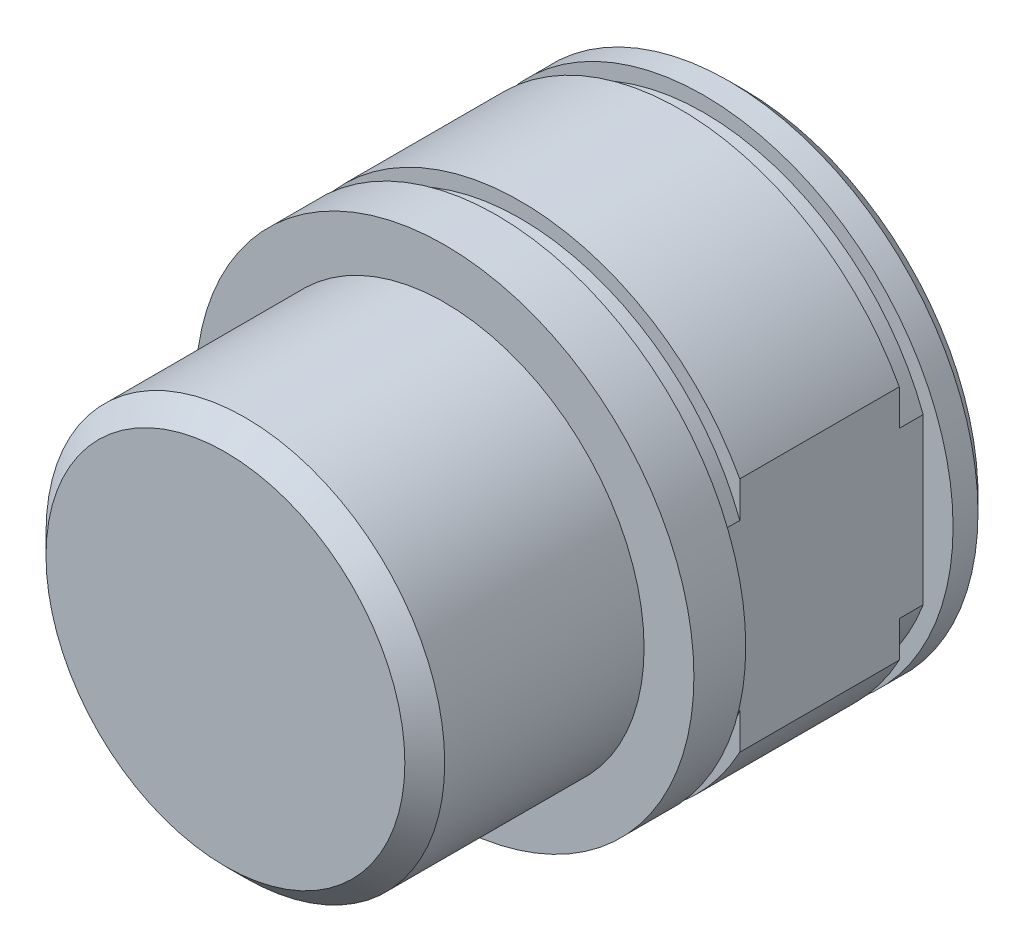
ISO-10303-21;
HEADER;
FILE_DESCRIPTION(('STEP AP214'),'2;1');
FILE_NAME('part.step','',(''),(''),'','','');
FILE_SCHEMA(('AUTOMOTIVE_DESIGN { 1 0 10303 214 1 1 1 1 }'));
ENDSEC;
DATA;
#1=APPLICATION_CONTEXT('core data for automotive mechanical design processes');
#2=APPLICATION_PROTOCOL_DEFINITION('international standard','automotive_design',2000,#1);
#3=PRODUCT_CONTEXT('',#1,'mechanical');
#4=PRODUCT('Part','Part','',(#3));
#5=PRODUCT_RELATED_PRODUCT_CATEGORY('part','',(#4));
#6=PRODUCT_DEFINITION_FORMATION('','',#4);
#7=PRODUCT_DEFINITION_CONTEXT('part definition',#1,'design');
#8=PRODUCT_DEFINITION('design','',#6,#7);
#9=PRODUCT_DEFINITION_SHAPE('','',#8);
#10=(LENGTH_UNIT() NAMED_UNIT(*) SI_UNIT(.MILLI.,.METRE.));
#11=(NAMED_UNIT(*) PLANE_ANGLE_UNIT() SI_UNIT($,.RADIAN.));
#12=(NAMED_UNIT(*) SI_UNIT($,.STERADIAN.) SOLID_ANGLE_UNIT());
#13=UNCERTAINTY_MEASURE_WITH_UNIT(LENGTH_MEASURE(1.E-05),#10,'distance_accuracy_value','');
#14=(GEOMETRIC_REPRESENTATION_CONTEXT(3) GLOBAL_UNCERTAINTY_ASSIGNED_CONTEXT((#13)) GLOBAL_UNIT_ASSIGNED_CONTEXT((#10,
#11,#12)) REPRESENTATION_CONTEXT('',''));
#15=CARTESIAN_POINT('',(0.,0.,0.));
#16=DIRECTION('',(0.,0.,1.));
#17=DIRECTION('',(1.,0.,0.));
#18=AXIS2_PLACEMENT_3D('',#15,#16,#17);
#19=CARTESIAN_POINT('',(0.,0.,26.));
#20=DIRECTION('',(0.,0.,-1.));
#21=DIRECTION('',(-1.,0.,0.));
#22=AXIS2_PLACEMENT_3D('',#19,#20,#21);
#23=PLANE('',#22);
#24=CARTESIAN_POINT('',(0.,0.,26.0000000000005));
#25=DIRECTION('',(0.,0.,-1.));
#26=DIRECTION('',(0.,1.,0.));
#27=AXIS2_PLACEMENT_3D('',#24,#25,#26);
#28=CIRCLE('',#27,9.00000000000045);
#29=CARTESIAN_POINT('',(0.,9.00000000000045,26.0000000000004));
#30=VERTEX_POINT('',#29);
#31=EDGE_CURVE('E21',#30,#30,#28,.T.);
#32=ORIENTED_EDGE('',*,*,#31,.F.);
#33=EDGE_LOOP('',(#32));
#34=FACE_BOUND('',#33,.T.);
#35=ADVANCED_FACE('F17',(#34),#23,.F.);
#36=CARTESIAN_POINT('',(0.,0.,25.));
#37=DIRECTION('',(0.,0.,-1.));
#38=DIRECTION('',(0.,1.,0.));
#39=AXIS2_PLACEMENT_3D('',#36,#37,#38);
#40=CONICAL_SURFACE('',#39,10.,0.785398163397);
#41=CARTESIAN_POINT('',(0.,0.,25.));
#42=DIRECTION('',(0.,0.,1.));
#43=DIRECTION('',(1.,0.,0.));
#44=AXIS2_PLACEMENT_3D('',#41,#42,#43);
#45=CIRCLE('',#44,10.);
#46=CARTESIAN_POINT('',(10.,0.,25.));
#47=VERTEX_POINT('',#46);
#48=EDGE_CURVE('E161',#47,#47,#45,.F.);
#49=ORIENTED_EDGE('',*,*,#48,.F.);
#50=EDGE_LOOP('',(#49));
#51=FACE_BOUND('',#50,.T.);
#52=ORIENTED_EDGE('',*,*,#31,.T.);
#53=EDGE_LOOP('',(#52));
#54=FACE_BOUND('',#53,.T.);
#55=ADVANCED_FACE('F437',(#51,#54),#40,.T.);
#56=CARTESIAN_POINT('',(0.,0.,15.));
#57=DIRECTION('',(0.,0.,1.));
#58=DIRECTION('',(1.,0.,0.));
#59=AXIS2_PLACEMENT_3D('',#56,#57,#58);
#60=CYLINDRICAL_SURFACE('',#59,10.);
#61=ORIENTED_EDGE('',*,*,#48,.T.);
#62=EDGE_LOOP('',(#61));
#63=FACE_BOUND('',#62,.T.);
#64=CARTESIAN_POINT('',(0.,0.,15.));
#65=DIRECTION('',(0.,0.,1.));
#66=DIRECTION('',(1.,0.,0.));
#67=AXIS2_PLACEMENT_3D('',#64,#65,#66);
#68=CIRCLE('',#67,10.);
#69=CARTESIAN_POINT('',(10.,0.,15.));
#70=VERTEX_POINT('',#69);
#71=EDGE_CURVE('E163',#70,#70,#68,.T.);
#72=ORIENTED_EDGE('',*,*,#71,.T.);
#73=EDGE_LOOP('',(#72));
#74=FACE_BOUND('',#73,.T.);
#75=ADVANCED_FACE('F210',(#63,#74),#60,.T.);
#76=CARTESIAN_POINT('',(0.,0.,15.));
#77=DIRECTION('',(0.,0.,-1.));
#78=DIRECTION('',(-1.,0.,0.));
#79=AXIS2_PLACEMENT_3D('',#76,#77,#78);
#80=PLANE('',#79);
#81=ORIENTED_EDGE('',*,*,#71,.F.);
#82=EDGE_LOOP('',(#81));
#83=FACE_BOUND('',#82,.T.);
#84=CARTESIAN_POINT('',(0.,0.,15.));
#85=DIRECTION('',(0.,0.,1.));
#86=DIRECTION('',(1.,0.,0.));
#87=AXIS2_PLACEMENT_3D('',#84,#85,#86);
#88=CIRCLE('',#87,12.5);
#89=CARTESIAN_POINT('',(12.5,0.,15.));
#90=VERTEX_POINT('',#89);
#91=EDGE_CURVE('E160',#90,#90,#88,.F.);
#92=ORIENTED_EDGE('',*,*,#91,.F.);
#93=EDGE_LOOP('',(#92));
#94=FACE_BOUND('',#93,.T.);
#95=ADVANCED_FACE('F212',(#83,#94),#80,.F.);
#96=CARTESIAN_POINT('',(0.,0.,0.));
#97=DIRECTION('',(0.,0.,1.));
#98=DIRECTION('',(1.,0.,0.));
#99=AXIS2_PLACEMENT_3D('',#96,#97,#98);
#100=CYLINDRICAL_SURFACE('',#99,12.5);
#101=ORIENTED_EDGE('',*,*,#91,.T.);
#102=EDGE_LOOP('',(#101));
#103=FACE_BOUND('',#102,.T.);
#104=CARTESIAN_POINT('',(0.,0.,12.4000000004));
#105=DIRECTION('',(0.,0.,1.));
#106=DIRECTION('',(1.,0.,0.));
#107=AXIS2_PLACEMENT_3D('',#104,#105,#106);
#108=CIRCLE('',#107,12.5);
#109=CARTESIAN_POINT('',(12.5,0.,12.4000000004));
#110=VERTEX_POINT('',#109);
#111=EDGE_CURVE('E199',#110,#110,#108,.T.);
#112=ORIENTED_EDGE('',*,*,#111,.T.);
#113=EDGE_LOOP('',(#112));
#114=FACE_BOUND('',#113,.T.);
#115=ADVANCED_FACE('F215',(#103,#114),#100,.T.);
#116=CARTESIAN_POINT('',(0.,0.,11.2));
#117=DIRECTION('',(0.,0.,1.));
#118=DIRECTION('',(1.,0.,0.));
#119=AXIS2_PLACEMENT_3D('',#116,#117,#118);
#120=CYLINDRICAL_SURFACE('',#119,11.75);
#121=DIRECTION('',(0.,0.,1.));
#122=VECTOR('',#121,1.);
#123=CARTESIAN_POINT('',(-10.9999999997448,4.13067791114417,11.2));
#124=LINE('',#123,#122);
#125=CARTESIAN_POINT('',(-10.9999999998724,4.13067791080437,11.2));
#126=VERTEX_POINT('',#125);
#127=CARTESIAN_POINT('',(-10.9999999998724,4.13067791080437,12.3999999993));
#128=VERTEX_POINT('',#127);
#129=EDGE_CURVE('E156',#126,#128,#124,.T.);
#130=ORIENTED_EDGE('',*,*,#129,.T.);
#131=CARTESIAN_POINT('',(0.,0.,12.3999999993));
#132=DIRECTION('',(0.,0.,1.));
#133=DIRECTION('',(1.,0.,0.));
#134=AXIS2_PLACEMENT_3D('',#131,#132,#133);
#135=CIRCLE('',#134,11.75);
#136=CARTESIAN_POINT('',(11.0000000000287,4.13067791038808,12.3999999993));
#137=VERTEX_POINT('',#136);
#138=EDGE_CURVE('E193',#128,#137,#135,.F.);
#139=ORIENTED_EDGE('',*,*,#138,.T.);
#140=DIRECTION('',(0.,0.,1.));
#141=VECTOR('',#140,1.);
#142=CARTESIAN_POINT('',(11.0000000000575,4.13067791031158,11.2));
#143=LINE('',#142,#141);
#144=CARTESIAN_POINT('',(11.0000000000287,4.13067791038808,11.2));
#145=VERTEX_POINT('',#144);
#146=EDGE_CURVE('E158',#137,#145,#143,.F.);
#147=ORIENTED_EDGE('',*,*,#146,.T.);
#148=CARTESIAN_POINT('',(0.,0.,11.2));
#149=DIRECTION('',(0.,0.,1.));
#150=DIRECTION('',(1.,0.,0.));
#151=AXIS2_PLACEMENT_3D('',#148,#149,#150);
#152=CIRCLE('',#151,11.75);
#153=EDGE_CURVE('E202',#126,#145,#152,.F.);
#154=ORIENTED_EDGE('',*,*,#153,.F.);
#155=EDGE_LOOP('',(#130,#139,#147,#154));
#156=FACE_BOUND('',#155,.T.);
#157=ADVANCED_FACE('F221',(#156),#120,.T.);
#158=CARTESIAN_POINT('',(0.,0.,11.2));
#159=DIRECTION('',(0.,0.,1.));
#160=DIRECTION('',(1.,0.,0.));
#161=AXIS2_PLACEMENT_3D('',#158,#159,#160);
#162=CYLINDRICAL_SURFACE('',#161,11.75);
#163=DIRECTION('',(0.,0.,1.));
#164=VECTOR('',#163,1.);
#165=CARTESIAN_POINT('',(-11.0000000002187,-4.13067790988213,11.2));
#166=LINE('',#165,#164);
#167=CARTESIAN_POINT('',(-11.0000000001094,-4.13067791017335,12.3999999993));
#168=VERTEX_POINT('',#167);
#169=CARTESIAN_POINT('',(-11.0000000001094,-4.13067791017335,11.2));
#170=VERTEX_POINT('',#169);
#171=EDGE_CURVE('E115',#168,#170,#166,.F.);
#172=ORIENTED_EDGE('',*,*,#171,.T.);
#173=CARTESIAN_POINT('',(0.,0.,11.2));
#174=DIRECTION('',(0.,0.,1.));
#175=DIRECTION('',(1.,0.,0.));
#176=AXIS2_PLACEMENT_3D('',#173,#174,#175);
#177=CIRCLE('',#176,11.75);
#178=CARTESIAN_POINT('',(10.999999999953,-4.13067791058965,11.2));
#179=VERTEX_POINT('',#178);
#180=EDGE_CURVE('E190',#179,#170,#177,.F.);
#181=ORIENTED_EDGE('',*,*,#180,.F.);
#182=DIRECTION('',(0.,0.,1.));
#183=VECTOR('',#182,1.);
#184=CARTESIAN_POINT('',(10.9999999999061,-4.13067791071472,11.2));
#185=LINE('',#184,#183);
#186=CARTESIAN_POINT('',(10.999999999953,-4.13067791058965,12.3999999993));
#187=VERTEX_POINT('',#186);
#188=EDGE_CURVE('E154',#179,#187,#185,.T.);
#189=ORIENTED_EDGE('',*,*,#188,.T.);
#190=CARTESIAN_POINT('',(0.,0.,12.3999999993));
#191=DIRECTION('',(0.,0.,1.));
#192=DIRECTION('',(1.,0.,0.));
#193=AXIS2_PLACEMENT_3D('',#190,#191,#192);
#194=CIRCLE('',#193,11.75);
#195=EDGE_CURVE('E196',#187,#168,#194,.F.);
#196=ORIENTED_EDGE('',*,*,#195,.T.);
#197=EDGE_LOOP('',(#172,#181,#189,#196));
#198=FACE_BOUND('',#197,.T.);
#199=ADVANCED_FACE('F323',(#198),#162,.T.);
#200=CARTESIAN_POINT('',(0.,0.,3.2));
#201=DIRECTION('',(0.,0.,1.));
#202=DIRECTION('',(1.,0.,0.));
#203=AXIS2_PLACEMENT_3D('',#200,#201,#202);
#204=PLANE('',#203);
#205=DIRECTION('',(0.,1.,0.));
#206=VECTOR('',#205,1.);
#207=CARTESIAN_POINT('',(11.,0.424748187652,3.19999999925));
#208=LINE('',#207,#206);
#209=CARTESIAN_POINT('',(11.,4.13067791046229,3.19999999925));
#210=VERTEX_POINT('',#209);
#211=CARTESIAN_POINT('',(11.,5.93717104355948,3.199999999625));
#212=VERTEX_POINT('',#211);
#213=EDGE_CURVE('E109',#210,#212,#208,.T.);
#214=ORIENTED_EDGE('',*,*,#213,.F.);
#215=CARTESIAN_POINT('',(0.,0.,3.19999999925));
#216=DIRECTION('',(0.,0.,1.));
#217=DIRECTION('',(1.,0.,0.));
#218=AXIS2_PLACEMENT_3D('',#215,#216,#217);
#219=CIRCLE('',#218,11.75);
#220=CARTESIAN_POINT('',(-10.9999999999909,4.13067791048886,3.19999999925));
#221=VERTEX_POINT('',#220);
#222=EDGE_CURVE('E181',#221,#210,#219,.F.);
#223=ORIENTED_EDGE('',*,*,#222,.F.);
#224=DIRECTION('',(0.,1.,0.));
#225=VECTOR('',#224,1.);
#226=CARTESIAN_POINT('',(-11.,-1.13011362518,3.19999999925));
#227=LINE('',#226,#225);
#228=CARTESIAN_POINT('',(-11.,5.93717104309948,3.199999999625));
#229=VERTEX_POINT('',#228);
#230=EDGE_CURVE('E111',#221,#229,#227,.T.);
#231=ORIENTED_EDGE('',*,*,#230,.T.);
#232=CARTESIAN_POINT('',(0.,0.,3.2));
#233=DIRECTION('',(0.,0.,1.));
#234=DIRECTION('',(1.,0.,0.));
#235=AXIS2_PLACEMENT_3D('',#232,#233,#234);
#236=CIRCLE('',#235,12.5);
#237=EDGE_CURVE('E104',#212,#229,#236,.T.);
#238=ORIENTED_EDGE('',*,*,#237,.F.);
#239=EDGE_LOOP('',(#214,#223,#231,#238));
#240=FACE_BOUND('',#239,.T.);
#241=ADVANCED_FACE('F106',(#240),#204,.F.);
#242=CARTESIAN_POINT('',(0.,0.,0.));
#243=DIRECTION('',(0.,0.,1.));
#244=DIRECTION('',(1.,0.,0.));
#245=AXIS2_PLACEMENT_3D('',#242,#243,#244);
#246=CYLINDRICAL_SURFACE('',#245,12.5);
#247=DIRECTION('',(0.,0.,1.));
#248=VECTOR('',#247,1.);
#249=CARTESIAN_POINT('',(-11.,5.93717104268,7.2));
#250=LINE('',#249,#248);
#251=CARTESIAN_POINT('',(-11.,5.93717104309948,11.2));
#252=VERTEX_POINT('',#251);
#253=EDGE_CURVE('E136',#229,#252,#250,.T.);
#254=ORIENTED_EDGE('',*,*,#253,.T.);
#255=CARTESIAN_POINT('',(0.,0.,11.2));
#256=DIRECTION('',(0.,0.,1.));
#257=DIRECTION('',(1.,0.,0.));
#258=AXIS2_PLACEMENT_3D('',#255,#256,#257);
#259=CIRCLE('',#258,12.5);
#260=CARTESIAN_POINT('',(11.,5.93717104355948,11.2));
#261=VERTEX_POINT('',#260);
#262=EDGE_CURVE('E114',#261,#252,#259,.T.);
#263=ORIENTED_EDGE('',*,*,#262,.F.);
#264=DIRECTION('',(0.,0.,1.));
#265=VECTOR('',#264,1.);
#266=CARTESIAN_POINT('',(11.,5.9371710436,7.2));
#267=LINE('',#266,#265);
#268=EDGE_CURVE('E118',#212,#261,#267,.T.);
#269=ORIENTED_EDGE('',*,*,#268,.F.);
#270=ORIENTED_EDGE('',*,*,#237,.T.);
#271=EDGE_LOOP('',(#254,#263,#269,#270));
#272=FACE_BOUND('',#271,.T.);
#273=ADVANCED_FACE('F119',(#272),#246,.T.);
#274=CARTESIAN_POINT('',(0.,0.,11.2));
#275=DIRECTION('',(0.,0.,1.));
#276=DIRECTION('',(1.,0.,0.));
#277=AXIS2_PLACEMENT_3D('',#274,#275,#276);
#278=PLANE('',#277);
#279=DIRECTION('',(0.,1.,0.));
#280=VECTOR('',#279,1.);
#281=CARTESIAN_POINT('',(-11.,-1.13011362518,11.2));
#282=LINE('',#281,#280);
#283=EDGE_CURVE('E139',#252,#126,#282,.F.);
#284=ORIENTED_EDGE('',*,*,#283,.T.);
#285=ORIENTED_EDGE('',*,*,#153,.T.);
#286=DIRECTION('',(0.,1.,0.));
#287=VECTOR('',#286,1.);
#288=CARTESIAN_POINT('',(11.,0.424748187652,11.2));
#289=LINE('',#288,#287);
#290=EDGE_CURVE('E124',#261,#145,#289,.F.);
#291=ORIENTED_EDGE('',*,*,#290,.F.);
#292=ORIENTED_EDGE('',*,*,#262,.T.);
#293=EDGE_LOOP('',(#284,#285,#291,#292));
#294=FACE_BOUND('',#293,.T.);
#295=ADVANCED_FACE('F228',(#294),#278,.T.);
#296=CARTESIAN_POINT('',(0.,0.,12.4));
#297=DIRECTION('',(0.,0.,1.));
#298=DIRECTION('',(1.,0.,0.));
#299=AXIS2_PLACEMENT_3D('',#296,#297,#298);
#300=PLANE('',#299);
#301=ORIENTED_EDGE('',*,*,#138,.F.);
#302=DIRECTION('',(0.,1.,0.));
#303=VECTOR('',#302,1.);
#304=CARTESIAN_POINT('',(-11.,-1.13011362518,12.3999999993));
#305=LINE('',#304,#303);
#306=EDGE_CURVE('E149',#128,#168,#305,.F.);
#307=ORIENTED_EDGE('',*,*,#306,.T.);
#308=ORIENTED_EDGE('',*,*,#195,.F.);
#309=DIRECTION('',(0.,1.,0.));
#310=VECTOR('',#309,1.);
#311=CARTESIAN_POINT('',(11.,0.424748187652,12.3999999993));
#312=LINE('',#311,#310);
#313=EDGE_CURVE('E314',#137,#187,#312,.F.);
#314=ORIENTED_EDGE('',*,*,#313,.F.);
#315=EDGE_LOOP('',(#301,#307,#308,#314));
#316=FACE_BOUND('',#315,.T.);
#317=ORIENTED_EDGE('',*,*,#111,.F.);
#318=EDGE_LOOP('',(#317));
#319=FACE_BOUND('',#318,.T.);
#320=ADVANCED_FACE('F225',(#316,#319),#300,.F.);
#321=CARTESIAN_POINT('',(0.,0.,11.2));
#322=DIRECTION('',(0.,0.,1.));
#323=DIRECTION('',(1.,0.,0.));
#324=AXIS2_PLACEMENT_3D('',#321,#322,#323);
#325=PLANE('',#324);
#326=DIRECTION('',(0.,1.,0.));
#327=VECTOR('',#326,1.);
#328=CARTESIAN_POINT('',(-11.,-1.13011362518,11.2));
#329=LINE('',#328,#327);
#330=CARTESIAN_POINT('',(-11.,-5.93717104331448,11.2));
#331=VERTEX_POINT('',#330);
#332=EDGE_CURVE('E147',#170,#331,#329,.F.);
#333=ORIENTED_EDGE('',*,*,#332,.T.);
#334=CARTESIAN_POINT('',(0.,0.,11.2));
#335=DIRECTION('',(0.,0.,1.));
#336=DIRECTION('',(1.,0.,0.));
#337=AXIS2_PLACEMENT_3D('',#334,#335,#336);
#338=CIRCLE('',#337,12.5);
#339=CARTESIAN_POINT('',(11.,-5.93717104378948,11.2));
#340=VERTEX_POINT('',#339);
#341=EDGE_CURVE('E187',#340,#331,#338,.F.);
#342=ORIENTED_EDGE('',*,*,#341,.F.);
#343=DIRECTION('',(0.,1.,0.));
#344=VECTOR('',#343,1.);
#345=CARTESIAN_POINT('',(11.,0.424748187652,11.2));
#346=LINE('',#345,#344);
#347=EDGE_CURVE('E310',#179,#340,#346,.F.);
#348=ORIENTED_EDGE('',*,*,#347,.F.);
#349=ORIENTED_EDGE('',*,*,#180,.T.);
#350=EDGE_LOOP('',(#333,#342,#348,#349));
#351=FACE_BOUND('',#350,.T.);
#352=ADVANCED_FACE('F227',(#351),#325,.T.);
#353=CARTESIAN_POINT('',(0.,0.,0.));
#354=DIRECTION('',(0.,0.,1.));
#355=DIRECTION('',(1.,0.,0.));
#356=AXIS2_PLACEMENT_3D('',#353,#354,#355);
#357=CYLINDRICAL_SURFACE('',#356,12.5);
#358=DIRECTION('',(0.,0.,1.));
#359=VECTOR('',#358,1.);
#360=CARTESIAN_POINT('',(-11.,-5.93717104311,7.2));
#361=LINE('',#360,#359);
#362=CARTESIAN_POINT('',(-11.,-5.93717104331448,3.2));
#363=VERTEX_POINT('',#362);
#364=EDGE_CURVE('E145',#331,#363,#361,.F.);
#365=ORIENTED_EDGE('',*,*,#364,.T.);
#366=CARTESIAN_POINT('',(0.,0.,3.2));
#367=DIRECTION('',(0.,0.,1.));
#368=DIRECTION('',(1.,0.,0.));
#369=AXIS2_PLACEMENT_3D('',#366,#367,#368);
#370=CIRCLE('',#369,12.5);
#371=CARTESIAN_POINT('',(11.,-5.93717104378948,3.2));
#372=VERTEX_POINT('',#371);
#373=EDGE_CURVE('E185',#363,#372,#370,.T.);
#374=ORIENTED_EDGE('',*,*,#373,.T.);
#375=DIRECTION('',(0.,0.,1.));
#376=VECTOR('',#375,1.);
#377=CARTESIAN_POINT('',(11.,-5.93717104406,7.2));
#378=LINE('',#377,#376);
#379=EDGE_CURVE('E308',#340,#372,#378,.F.);
#380=ORIENTED_EDGE('',*,*,#379,.F.);
#381=ORIENTED_EDGE('',*,*,#341,.T.);
#382=EDGE_LOOP('',(#365,#374,#380,#381));
#383=FACE_BOUND('',#382,.T.);
#384=ADVANCED_FACE('F236',(#383),#357,.T.);
#385=CARTESIAN_POINT('',(0.,0.,3.2));
#386=DIRECTION('',(0.,0.,1.));
#387=DIRECTION('',(1.,0.,0.));
#388=AXIS2_PLACEMENT_3D('',#385,#386,#387);
#389=PLANE('',#388);
#390=DIRECTION('',(0.,1.,0.));
#391=VECTOR('',#390,1.);
#392=CARTESIAN_POINT('',(11.,0.424748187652,3.2));
#393=LINE('',#392,#391);
#394=CARTESIAN_POINT('',(11.,-4.13067791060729,3.2));
#395=VERTEX_POINT('',#394);
#396=EDGE_CURVE('E180',#372,#395,#393,.T.);
#397=ORIENTED_EDGE('',*,*,#396,.F.);
#398=ORIENTED_EDGE('',*,*,#373,.F.);
#399=DIRECTION('',(0.,1.,0.));
#400=VECTOR('',#399,1.);
#401=CARTESIAN_POINT('',(-11.,-1.13011362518,3.2));
#402=LINE('',#401,#400);
#403=CARTESIAN_POINT('',(-11.,-4.13067791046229,3.2));
#404=VERTEX_POINT('',#403);
#405=EDGE_CURVE('E143',#363,#404,#402,.T.);
#406=ORIENTED_EDGE('',*,*,#405,.T.);
#407=CARTESIAN_POINT('',(0.,0.,3.2));
#408=DIRECTION('',(0.,0.,1.));
#409=DIRECTION('',(1.,0.,0.));
#410=AXIS2_PLACEMENT_3D('',#407,#408,#409);
#411=CIRCLE('',#410,11.75);
#412=EDGE_CURVE('E152',#395,#404,#411,.F.);
#413=ORIENTED_EDGE('',*,*,#412,.F.);
#414=EDGE_LOOP('',(#397,#398,#406,#413));
#415=FACE_BOUND('',#414,.T.);
#416=ADVANCED_FACE('F285',(#415),#389,.F.);
#417=CARTESIAN_POINT('',(0.,0.,2.));
#418=DIRECTION('',(0.,0.,1.));
#419=DIRECTION('',(1.,0.,0.));
#420=AXIS2_PLACEMENT_3D('',#417,#418,#419);
#421=CYLINDRICAL_SURFACE('',#420,11.75);
#422=DIRECTION('',(0.,0.,1.));
#423=VECTOR('',#422,1.);
#424=CARTESIAN_POINT('',(-11.,-4.13067791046,7.2));
#425=LINE('',#424,#423);
#426=CARTESIAN_POINT('',(-11.,-4.13067791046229,2.));
#427=VERTEX_POINT('',#426);
#428=EDGE_CURVE('E137',#404,#427,#425,.F.);
#429=ORIENTED_EDGE('',*,*,#428,.T.);
#430=CARTESIAN_POINT('',(0.,0.,2.));
#431=DIRECTION('',(0.,0.,1.));
#432=DIRECTION('',(1.,0.,0.));
#433=AXIS2_PLACEMENT_3D('',#430,#431,#432);
#434=CIRCLE('',#433,11.75);
#435=CARTESIAN_POINT('',(11.,-4.13067791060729,2.));
#436=VERTEX_POINT('',#435);
#437=EDGE_CURVE('E177',#436,#427,#434,.F.);
#438=ORIENTED_EDGE('',*,*,#437,.F.);
#439=DIRECTION('',(0.,0.,1.));
#440=VECTOR('',#439,1.);
#441=CARTESIAN_POINT('',(11.,-4.13067791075,7.2));
#442=LINE('',#441,#440);
#443=EDGE_CURVE('E131',#395,#436,#442,.F.);
#444=ORIENTED_EDGE('',*,*,#443,.F.);
#445=ORIENTED_EDGE('',*,*,#412,.T.);
#446=EDGE_LOOP('',(#429,#438,#444,#445));
#447=FACE_BOUND('',#446,.T.);
#448=ADVANCED_FACE('F281',(#447),#421,.T.);
#449=CARTESIAN_POINT('',(-11.,-1.13011362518,7.2));
#450=DIRECTION('',(1.,0.,0.));
#451=DIRECTION('',(0.,1.,0.));
#452=AXIS2_PLACEMENT_3D('',#449,#450,#451);
#453=PLANE('',#452);
#454=ORIENTED_EDGE('',*,*,#253,.F.);
#455=ORIENTED_EDGE('',*,*,#230,.F.);
#456=DIRECTION('',(0.,0.,1.));
#457=VECTOR('',#456,1.);
#458=CARTESIAN_POINT('',(-10.9999999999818,4.13067791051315,2.));
#459=LINE('',#458,#457);
#460=CARTESIAN_POINT('',(-10.9999999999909,4.13067791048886,2.));
#461=VERTEX_POINT('',#460);
#462=EDGE_CURVE('E142',#461,#221,#459,.T.);
#463=ORIENTED_EDGE('',*,*,#462,.F.);
#464=DIRECTION('',(0.,1.,0.));
#465=VECTOR('',#464,1.);
#466=CARTESIAN_POINT('',(-11.,0.,2.));
#467=LINE('',#466,#465);
#468=EDGE_CURVE('E176',#427,#461,#467,.T.);
#469=ORIENTED_EDGE('',*,*,#468,.F.);
#470=ORIENTED_EDGE('',*,*,#428,.F.);
#471=ORIENTED_EDGE('',*,*,#405,.F.);
#472=ORIENTED_EDGE('',*,*,#364,.F.);
#473=ORIENTED_EDGE('',*,*,#332,.F.);
#474=ORIENTED_EDGE('',*,*,#171,.F.);
#475=ORIENTED_EDGE('',*,*,#306,.F.);
#476=ORIENTED_EDGE('',*,*,#129,.F.);
#477=ORIENTED_EDGE('',*,*,#283,.F.);
#478=EDGE_LOOP('',(#454,#455,#463,#469,#470,#471,#472,#473,#474,#475,#476,#477));
#479=FACE_BOUND('',#478,.T.);
#480=ADVANCED_FACE('F277',(#479),#453,.F.);
#481=CARTESIAN_POINT('',(0.,0.,2.));
#482=DIRECTION('',(0.,0.,1.));
#483=DIRECTION('',(1.,0.,0.));
#484=AXIS2_PLACEMENT_3D('',#481,#482,#483);
#485=CYLINDRICAL_SURFACE('',#484,11.75);
#486=ORIENTED_EDGE('',*,*,#462,.T.);
#487=ORIENTED_EDGE('',*,*,#222,.T.);
#488=DIRECTION('',(0.,0.,1.));
#489=VECTOR('',#488,1.);
#490=CARTESIAN_POINT('',(11.,4.13067791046,7.2));
#491=LINE('',#490,#489);
#492=CARTESIAN_POINT('',(11.,4.13067791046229,2.));
#493=VERTEX_POINT('',#492);
#494=EDGE_CURVE('E129',#493,#210,#491,.T.);
#495=ORIENTED_EDGE('',*,*,#494,.F.);
#496=CARTESIAN_POINT('',(0.,0.,2.));
#497=DIRECTION('',(0.,0.,1.));
#498=DIRECTION('',(1.,0.,0.));
#499=AXIS2_PLACEMENT_3D('',#496,#497,#498);
#500=CIRCLE('',#499,11.75);
#501=EDGE_CURVE('E173',#461,#493,#500,.F.);
#502=ORIENTED_EDGE('',*,*,#501,.F.);
#503=EDGE_LOOP('',(#486,#487,#495,#502));
#504=FACE_BOUND('',#503,.T.);
#505=ADVANCED_FACE('F274',(#504),#485,.T.);
#506=CARTESIAN_POINT('',(11.,0.424748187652,7.2));
#507=DIRECTION('',(1.,0.,0.));
#508=DIRECTION('',(0.,1.,0.));
#509=AXIS2_PLACEMENT_3D('',#506,#507,#508);
#510=PLANE('',#509);
#511=ORIENTED_EDGE('',*,*,#379,.T.);
#512=ORIENTED_EDGE('',*,*,#396,.T.);
#513=ORIENTED_EDGE('',*,*,#443,.T.);
#514=DIRECTION('',(0.,1.,0.));
#515=VECTOR('',#514,1.);
#516=CARTESIAN_POINT('',(11.,0.,2.));
#517=LINE('',#516,#515);
#518=EDGE_CURVE('E172',#493,#436,#517,.F.);
#519=ORIENTED_EDGE('',*,*,#518,.F.);
#520=ORIENTED_EDGE('',*,*,#494,.T.);
#521=ORIENTED_EDGE('',*,*,#213,.T.);
#522=ORIENTED_EDGE('',*,*,#268,.T.);
#523=ORIENTED_EDGE('',*,*,#290,.T.);
#524=ORIENTED_EDGE('',*,*,#146,.F.);
#525=ORIENTED_EDGE('',*,*,#313,.T.);
#526=ORIENTED_EDGE('',*,*,#188,.F.);
#527=ORIENTED_EDGE('',*,*,#347,.T.);
#528=EDGE_LOOP('',(#511,#512,#513,#519,#520,#521,#522,#523,#524,#525,#526,#527));
#529=FACE_BOUND('',#528,.T.);
#530=ADVANCED_FACE('F127',(#529),#510,.T.);
#531=CARTESIAN_POINT('',(0.,0.,2.));
#532=DIRECTION('',(0.,0.,1.));
#533=DIRECTION('',(1.,0.,0.));
#534=AXIS2_PLACEMENT_3D('',#531,#532,#533);
#535=PLANE('',#534);
#536=ORIENTED_EDGE('',*,*,#501,.T.);
#537=ORIENTED_EDGE('',*,*,#518,.T.);
#538=ORIENTED_EDGE('',*,*,#437,.T.);
#539=ORIENTED_EDGE('',*,*,#468,.T.);
#540=EDGE_LOOP('',(#536,#537,#538,#539));
#541=FACE_BOUND('',#540,.T.);
#542=CARTESIAN_POINT('',(0.,0.,2.));
#543=DIRECTION('',(0.,0.,1.));
#544=DIRECTION('',(1.,0.,0.));
#545=AXIS2_PLACEMENT_3D('',#542,#543,#544);
#546=CIRCLE('',#545,12.5);
#547=CARTESIAN_POINT('',(12.5,0.,2.));
#548=VERTEX_POINT('',#547);
#549=EDGE_CURVE('E168',#548,#548,#546,.F.);
#550=ORIENTED_EDGE('',*,*,#549,.F.);
#551=EDGE_LOOP('',(#550));
#552=FACE_BOUND('',#551,.T.);
#553=ADVANCED_FACE('F267',(#541,#552),#535,.T.);
#554=CARTESIAN_POINT('',(0.,0.,0.));
#555=DIRECTION('',(0.,0.,1.));
#556=DIRECTION('',(1.,0.,0.));
#557=AXIS2_PLACEMENT_3D('',#554,#555,#556);
#558=CYLINDRICAL_SURFACE('',#557,12.5);
#559=ORIENTED_EDGE('',*,*,#549,.T.);
#560=EDGE_LOOP('',(#559));
#561=FACE_BOUND('',#560,.T.);
#562=CARTESIAN_POINT('',(0.,0.,0.750000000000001));
#563=DIRECTION('',(0.,0.,1.));
#564=DIRECTION('',(1.,0.,0.));
#565=AXIS2_PLACEMENT_3D('',#562,#563,#564);
#566=CIRCLE('',#565,12.5);
#567=CARTESIAN_POINT('',(12.5,0.,0.75));
#568=VERTEX_POINT('',#567);
#569=EDGE_CURVE('E171',#568,#568,#566,.F.);
#570=ORIENTED_EDGE('',*,*,#569,.F.);
#571=EDGE_LOOP('',(#570));
#572=FACE_BOUND('',#571,.T.);
#573=ADVANCED_FACE('F261',(#561,#572),#558,.T.);
#574=CARTESIAN_POINT('',(0.,0.,22.0000000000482));
#575=DIRECTION('',(0.,0.,-1.));
#576=DIRECTION('',(-1.,0.,0.));
#577=AXIS2_PLACEMENT_3D('',#574,#575,#576);
#578=CONICAL_SURFACE('',#577,4.18799999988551,1.02974425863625);
#579=CARTESIAN_POINT('',(-1.98951966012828E-10,0.,24.5164042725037));
#580=VERTEX_POINT('',#579);
#581=VERTEX_LOOP('',#580);
#582=FACE_BOUND('',#581,.T.);
#583=CARTESIAN_POINT('',(0.,0.,22.));
#584=DIRECTION('',(0.,0.,-1.));
#585=DIRECTION('',(-1.,0.,0.));
#586=AXIS2_PLACEMENT_3D('',#583,#584,#585);
#587=CIRCLE('',#586,4.188);
#588=CARTESIAN_POINT('',(-4.188,0.,22.));
#589=VERTEX_POINT('',#588);
#590=EDGE_CURVE('E167',#589,#589,#587,.T.);
#591=ORIENTED_EDGE('',*,*,#590,.T.);
#592=EDGE_LOOP('',(#591));
#593=FACE_BOUND('',#592,.T.);
#594=ADVANCED_FACE('F255',(#582,#593),#578,.F.);
#595=CARTESIAN_POINT('',(0.,0.,0.75));
#596=DIRECTION('',(0.,0.,1.));
#597=DIRECTION('',(0.,-1.,0.));
#598=AXIS2_PLACEMENT_3D('',#595,#596,#597);
#599=CONICAL_SURFACE('',#598,12.5,0.785398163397);
#600=ORIENTED_EDGE('',*,*,#569,.T.);
#601=EDGE_LOOP('',(#600));
#602=FACE_BOUND('',#601,.T.);
#603=CARTESIAN_POINT('',(0.,0.,-3.36536354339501E-13));
#604=DIRECTION('',(0.,0.,1.));
#605=DIRECTION('',(0.,-1.,0.));
#606=AXIS2_PLACEMENT_3D('',#603,#604,#605);
#607=CIRCLE('',#606,11.7500000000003);
#608=CARTESIAN_POINT('',(0.,-11.7500000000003,-3.36587311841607E-13));
#609=VERTEX_POINT('',#608);
#610=EDGE_CURVE('E27',#609,#609,#607,.F.);
#611=ORIENTED_EDGE('',*,*,#610,.F.);
#612=EDGE_LOOP('',(#611));
#613=FACE_BOUND('',#612,.T.);
#614=ADVANCED_FACE('F248',(#602,#613),#599,.T.);
#615=CARTESIAN_POINT('',(0.,0.,11.));
#616=DIRECTION('',(0.,0.,-1.));
#617=DIRECTION('',(-1.,0.,0.));
#618=AXIS2_PLACEMENT_3D('',#615,#616,#617);
#619=CYLINDRICAL_SURFACE('',#618,4.188);
#620=ORIENTED_EDGE('',*,*,#590,.F.);
#621=EDGE_LOOP('',(#620));
#622=FACE_BOUND('',#621,.T.);
#623=CARTESIAN_POINT('',(0.,0.,0.));
#624=DIRECTION('',(0.,0.,-1.));
#625=DIRECTION('',(-1.,0.,0.));
#626=AXIS2_PLACEMENT_3D('',#623,#624,#625);
#627=CIRCLE('',#626,4.188);
#628=CARTESIAN_POINT('',(-4.188,0.,0.));
#629=VERTEX_POINT('',#628);
#630=EDGE_CURVE('E11',#629,#629,#627,.F.);
#631=ORIENTED_EDGE('',*,*,#630,.F.);
#632=EDGE_LOOP('',(#631));
#633=FACE_BOUND('',#632,.T.);
#634=ADVANCED_FACE('F243',(#622,#633),#619,.F.);
#635=CARTESIAN_POINT('',(0.,0.,0.));
#636=DIRECTION('',(0.,0.,-1.));
#637=DIRECTION('',(-1.,0.,0.));
#638=AXIS2_PLACEMENT_3D('',#635,#636,#637);
#639=PLANE('',#638);
#640=ORIENTED_EDGE('',*,*,#630,.T.);
#641=EDGE_LOOP('',(#640));
#642=FACE_BOUND('',#641,.T.);
#643=ORIENTED_EDGE('',*,*,#610,.T.);
#644=EDGE_LOOP('',(#643));
#645=FACE_BOUND('',#644,.T.);
#646=ADVANCED_FACE('F19',(#642,#645),#639,.T.);
#647=CLOSED_SHELL('',(#35,#55,#75,#95,#115,#157,#199,#241,#273,#295,#320,#352,#384,#416,#448,
#480,#505,#530,#553,#573,#594,#614,#634,#646));
#648=MANIFOLD_SOLID_BREP('B1',#647);
#649=ADVANCED_BREP_SHAPE_REPRESENTATION('',(#18,#648),#14);
#650=SHAPE_DEFINITION_REPRESENTATION(#9,#649);
ENDSEC;
END-ISO-10303-21;
